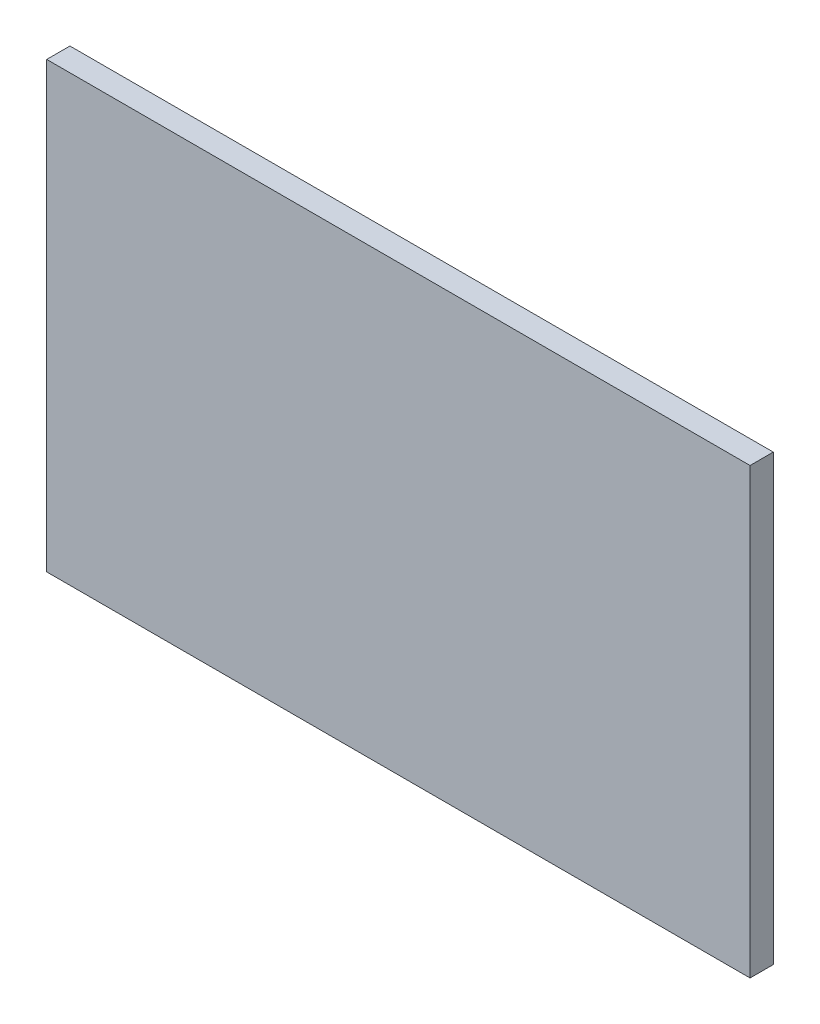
from build123d import *

# Parameters (mm, degrees)
ESQUISSE1_W        = 309
ESQUISSE1_H        = 195
BOSS_EXTRU_1_DEPTH = 5.1


with BuildPart() as part:
    # Esquisse1 → Boss.-Extru.1 (new, symmetric)
    with BuildSketch(Plane.XY):
        Rectangle(ESQUISSE1_W, ESQUISSE1_H)
    extrude(amount=BOSS_EXTRU_1_DEPTH, both=True)


solid = part.part
